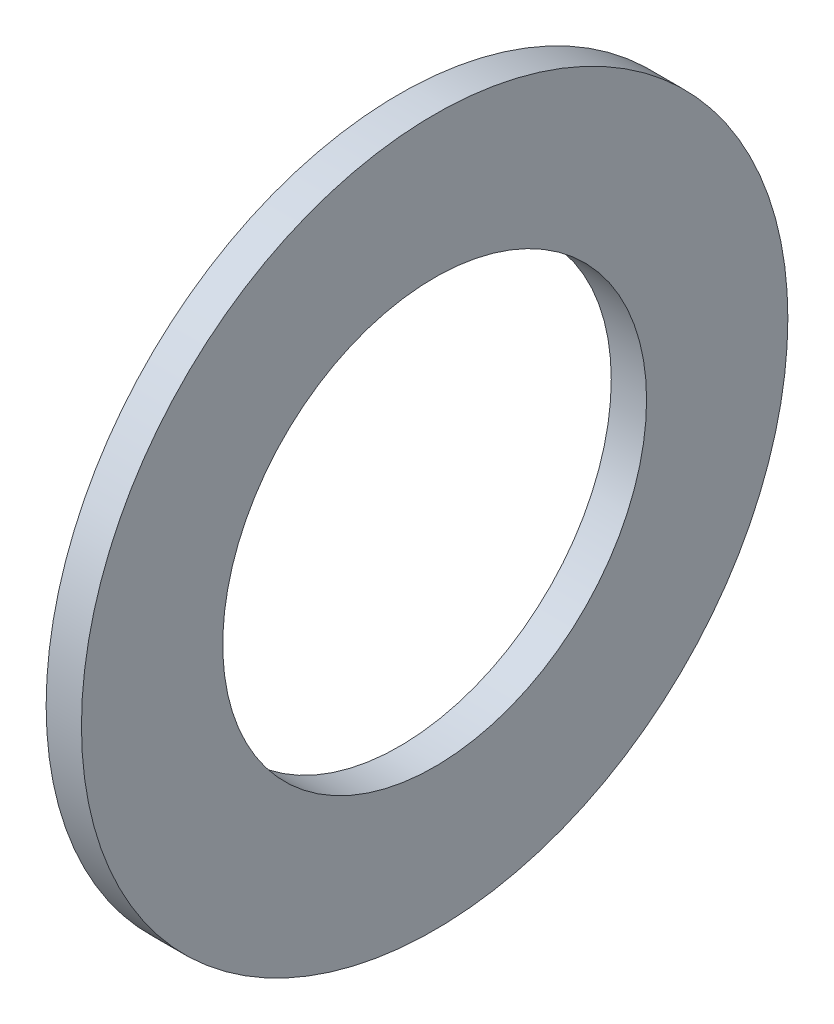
ISO-10303-21;
HEADER;
FILE_DESCRIPTION(('STEP AP214'),'2;1');
FILE_NAME('part.step','',(''),(''),'','','');
FILE_SCHEMA(('AUTOMOTIVE_DESIGN { 1 0 10303 214 1 1 1 1 }'));
ENDSEC;
DATA;
#1=APPLICATION_CONTEXT('core data for automotive mechanical design processes');
#2=APPLICATION_PROTOCOL_DEFINITION('international standard','automotive_design',2000,#1);
#3=PRODUCT_CONTEXT('',#1,'mechanical');
#4=PRODUCT('Part','Part','',(#3));
#5=PRODUCT_RELATED_PRODUCT_CATEGORY('part','',(#4));
#6=PRODUCT_DEFINITION_FORMATION('','',#4);
#7=PRODUCT_DEFINITION_CONTEXT('part definition',#1,'design');
#8=PRODUCT_DEFINITION('design','',#6,#7);
#9=PRODUCT_DEFINITION_SHAPE('','',#8);
#10=(LENGTH_UNIT() NAMED_UNIT(*) SI_UNIT(.MILLI.,.METRE.));
#11=(NAMED_UNIT(*) PLANE_ANGLE_UNIT() SI_UNIT($,.RADIAN.));
#12=(NAMED_UNIT(*) SI_UNIT($,.STERADIAN.) SOLID_ANGLE_UNIT());
#13=UNCERTAINTY_MEASURE_WITH_UNIT(LENGTH_MEASURE(1.E-05),#10,'distance_accuracy_value','');
#14=(GEOMETRIC_REPRESENTATION_CONTEXT(3) GLOBAL_UNCERTAINTY_ASSIGNED_CONTEXT((#13)) GLOBAL_UNIT_ASSIGNED_CONTEXT((#10,
#11,#12)) REPRESENTATION_CONTEXT('',''));
#15=CARTESIAN_POINT('',(0.,0.,0.));
#16=DIRECTION('',(0.,0.,1.));
#17=DIRECTION('',(1.,0.,0.));
#18=AXIS2_PLACEMENT_3D('',#15,#16,#17);
#19=CARTESIAN_POINT('',(1.,0.,0.));
#20=DIRECTION('',(1.,0.,0.));
#21=DIRECTION('',(0.,0.,-1.));
#22=AXIS2_PLACEMENT_3D('',#19,#20,#21);
#23=PLANE('',#22);
#24=CARTESIAN_POINT('',(1.,0.,0.));
#25=DIRECTION('',(1.,0.,0.));
#26=DIRECTION('',(0.,0.,-1.));
#27=AXIS2_PLACEMENT_3D('',#24,#25,#26);
#28=CIRCLE('',#27,6.);
#29=CARTESIAN_POINT('',(1.,0.,-6.));
#30=VERTEX_POINT('',#29);
#31=EDGE_CURVE('E27',#30,#30,#28,.F.);
#32=ORIENTED_EDGE('',*,*,#31,.T.);
#33=EDGE_LOOP('',(#32));
#34=FACE_BOUND('',#33,.T.);
#35=CARTESIAN_POINT('',(1.,0.,0.));
#36=DIRECTION('',(1.,0.,0.));
#37=DIRECTION('',(0.,0.,-1.));
#38=AXIS2_PLACEMENT_3D('',#35,#36,#37);
#39=CIRCLE('',#38,10.);
#40=CARTESIAN_POINT('',(1.,0.,-10.));
#41=VERTEX_POINT('',#40);
#42=EDGE_CURVE('E18',#41,#41,#39,.F.);
#43=ORIENTED_EDGE('',*,*,#42,.F.);
#44=EDGE_LOOP('',(#43));
#45=FACE_BOUND('',#44,.T.);
#46=ADVANCED_FACE('F15',(#34,#45),#23,.T.);
#47=CARTESIAN_POINT('',(0.,0.,0.));
#48=DIRECTION('',(1.,0.,0.));
#49=DIRECTION('',(0.,0.,-1.));
#50=AXIS2_PLACEMENT_3D('',#47,#48,#49);
#51=CYLINDRICAL_SURFACE('',#50,10.);
#52=ORIENTED_EDGE('',*,*,#42,.T.);
#53=EDGE_LOOP('',(#52));
#54=FACE_BOUND('',#53,.T.);
#55=CARTESIAN_POINT('',(0.,0.,0.));
#56=DIRECTION('',(1.,0.,0.));
#57=DIRECTION('',(0.,0.,-1.));
#58=AXIS2_PLACEMENT_3D('',#55,#56,#57);
#59=CIRCLE('',#58,10.);
#60=CARTESIAN_POINT('',(0.,0.,-10.));
#61=VERTEX_POINT('',#60);
#62=EDGE_CURVE('E22',#61,#61,#59,.T.);
#63=ORIENTED_EDGE('',*,*,#62,.T.);
#64=EDGE_LOOP('',(#63));
#65=FACE_BOUND('',#64,.T.);
#66=ADVANCED_FACE('F35',(#54,#65),#51,.T.);
#67=CARTESIAN_POINT('',(0.,0.,0.));
#68=DIRECTION('',(1.,0.,0.));
#69=DIRECTION('',(0.,0.,-1.));
#70=AXIS2_PLACEMENT_3D('',#67,#68,#69);
#71=CYLINDRICAL_SURFACE('',#70,6.);
#72=ORIENTED_EDGE('',*,*,#31,.F.);
#73=EDGE_LOOP('',(#72));
#74=FACE_BOUND('',#73,.T.);
#75=CARTESIAN_POINT('',(0.,0.,0.));
#76=DIRECTION('',(1.,0.,0.));
#77=DIRECTION('',(0.,0.,-1.));
#78=AXIS2_PLACEMENT_3D('',#75,#76,#77);
#79=CIRCLE('',#78,6.);
#80=CARTESIAN_POINT('',(0.,0.,-6.));
#81=VERTEX_POINT('',#80);
#82=EDGE_CURVE('E10',#81,#81,#79,.F.);
#83=ORIENTED_EDGE('',*,*,#82,.T.);
#84=EDGE_LOOP('',(#83));
#85=FACE_BOUND('',#84,.T.);
#86=ADVANCED_FACE('F43',(#74,#85),#71,.F.);
#87=CARTESIAN_POINT('',(0.,0.,0.));
#88=DIRECTION('',(1.,0.,0.));
#89=DIRECTION('',(0.,0.,-1.));
#90=AXIS2_PLACEMENT_3D('',#87,#88,#89);
#91=PLANE('',#90);
#92=ORIENTED_EDGE('',*,*,#82,.F.);
#93=EDGE_LOOP('',(#92));
#94=FACE_BOUND('',#93,.T.);
#95=ORIENTED_EDGE('',*,*,#62,.F.);
#96=EDGE_LOOP('',(#95));
#97=FACE_BOUND('',#96,.T.);
#98=ADVANCED_FACE('F44',(#94,#97),#91,.F.);
#99=CLOSED_SHELL('',(#46,#66,#86,#98));
#100=MANIFOLD_SOLID_BREP('B1',#99);
#101=ADVANCED_BREP_SHAPE_REPRESENTATION('',(#18,#100),#14);
#102=SHAPE_DEFINITION_REPRESENTATION(#9,#101);
ENDSEC;
END-ISO-10303-21;
